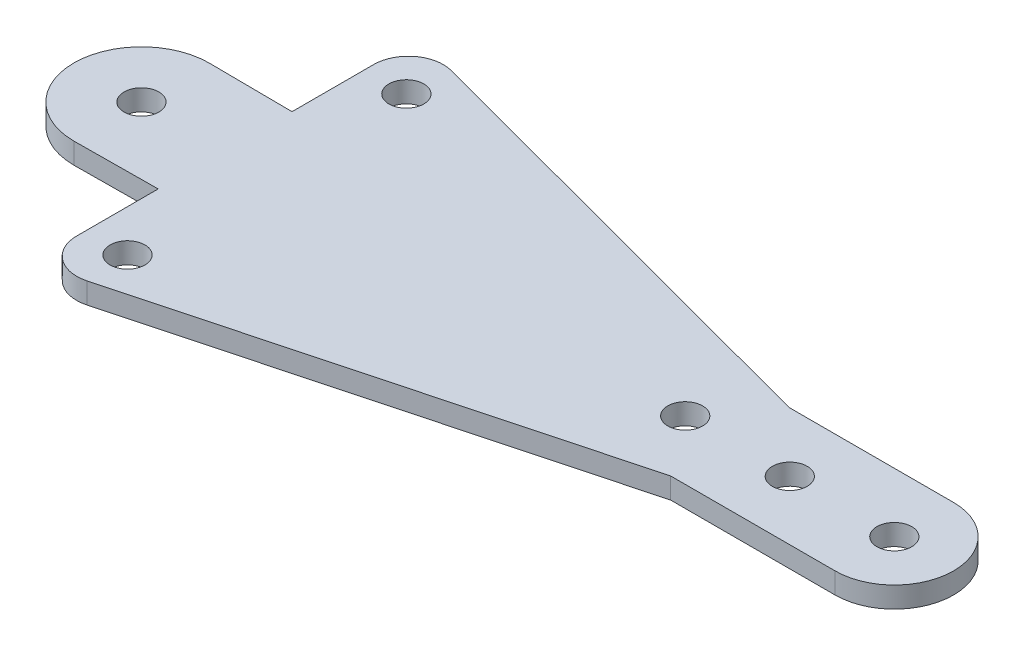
ISO-10303-21;
HEADER;
FILE_DESCRIPTION(('STEP AP214'),'2;1');
FILE_NAME('part.step','',(''),(''),'','','');
FILE_SCHEMA(('AUTOMOTIVE_DESIGN { 1 0 10303 214 1 1 1 1 }'));
ENDSEC;
DATA;
#1=APPLICATION_CONTEXT('core data for automotive mechanical design processes');
#2=APPLICATION_PROTOCOL_DEFINITION('international standard','automotive_design',2000,#1);
#3=PRODUCT_CONTEXT('',#1,'mechanical');
#4=PRODUCT('Part','Part','',(#3));
#5=PRODUCT_RELATED_PRODUCT_CATEGORY('part','',(#4));
#6=PRODUCT_DEFINITION_FORMATION('','',#4);
#7=PRODUCT_DEFINITION_CONTEXT('part definition',#1,'design');
#8=PRODUCT_DEFINITION('design','',#6,#7);
#9=PRODUCT_DEFINITION_SHAPE('','',#8);
#10=(LENGTH_UNIT() NAMED_UNIT(*) SI_UNIT(.MILLI.,.METRE.));
#11=(NAMED_UNIT(*) PLANE_ANGLE_UNIT() SI_UNIT($,.RADIAN.));
#12=(NAMED_UNIT(*) SI_UNIT($,.STERADIAN.) SOLID_ANGLE_UNIT());
#13=UNCERTAINTY_MEASURE_WITH_UNIT(LENGTH_MEASURE(1.E-05),#10,'distance_accuracy_value','');
#14=(GEOMETRIC_REPRESENTATION_CONTEXT(3) GLOBAL_UNCERTAINTY_ASSIGNED_CONTEXT((#13)) GLOBAL_UNIT_ASSIGNED_CONTEXT((#10,
#11,#12)) REPRESENTATION_CONTEXT('',''));
#15=CARTESIAN_POINT('',(0.,0.,0.));
#16=DIRECTION('',(0.,0.,1.));
#17=DIRECTION('',(1.,0.,0.));
#18=AXIS2_PLACEMENT_3D('',#15,#16,#17);
#19=CARTESIAN_POINT('',(-38.5,3.,21.3016116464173));
#20=DIRECTION('',(0.,-1.,0.));
#21=DIRECTION('',(0.,0.,-1.));
#22=AXIS2_PLACEMENT_3D('',#19,#20,#21);
#23=PLANE('',#22);
#24=CARTESIAN_POINT('',(-55.5000000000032,3.,1.02140518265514E-11));
#25=DIRECTION('',(0.,-1.,0.));
#26=DIRECTION('',(0.,0.,-1.));
#27=AXIS2_PLACEMENT_3D('',#24,#25,#26);
#28=CIRCLE('',#27,2.5);
#29=CARTESIAN_POINT('',(-55.5000000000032,3.,-2.49999999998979));
#30=VERTEX_POINT('',#29);
#31=EDGE_CURVE('E215',#30,#30,#28,.T.);
#32=ORIENTED_EDGE('',*,*,#31,.T.);
#33=EDGE_LOOP('',(#32));
#34=FACE_BOUND('',#33,.T.);
#35=CARTESIAN_POINT('',(52.5,3.,0.));
#36=DIRECTION('',(0.,-1.,0.));
#37=DIRECTION('',(0.,0.,-1.));
#38=AXIS2_PLACEMENT_3D('',#35,#36,#37);
#39=CIRCLE('',#38,2.5);
#40=CARTESIAN_POINT('',(52.5,3.,-2.5));
#41=VERTEX_POINT('',#40);
#42=EDGE_CURVE('E218',#41,#41,#39,.T.);
#43=ORIENTED_EDGE('',*,*,#42,.T.);
#44=EDGE_LOOP('',(#43));
#45=FACE_BOUND('',#44,.T.);
#46=CARTESIAN_POINT('',(22.5,3.,0.));
#47=DIRECTION('',(0.,-1.,0.));
#48=DIRECTION('',(0.,0.,-1.));
#49=AXIS2_PLACEMENT_3D('',#46,#47,#48);
#50=CIRCLE('',#49,2.5);
#51=CARTESIAN_POINT('',(22.5,3.,-2.5));
#52=VERTEX_POINT('',#51);
#53=EDGE_CURVE('E230',#52,#52,#50,.T.);
#54=ORIENTED_EDGE('',*,*,#53,.T.);
#55=EDGE_LOOP('',(#54));
#56=FACE_BOUND('',#55,.T.);
#57=CARTESIAN_POINT('',(-37.5,3.,20.));
#58=DIRECTION('',(0.,-1.,0.));
#59=DIRECTION('',(0.,0.,-1.));
#60=AXIS2_PLACEMENT_3D('',#57,#58,#59);
#61=CIRCLE('',#60,2.5);
#62=CARTESIAN_POINT('',(-37.5,3.,17.5));
#63=VERTEX_POINT('',#62);
#64=EDGE_CURVE('E221',#63,#63,#61,.T.);
#65=ORIENTED_EDGE('',*,*,#64,.T.);
#66=EDGE_LOOP('',(#65));
#67=FACE_BOUND('',#66,.T.);
#68=CARTESIAN_POINT('',(37.5,3.,0.));
#69=DIRECTION('',(0.,-1.,0.));
#70=DIRECTION('',(0.,0.,-1.));
#71=AXIS2_PLACEMENT_3D('',#68,#69,#70);
#72=CIRCLE('',#71,2.5);
#73=CARTESIAN_POINT('',(37.5,3.,-2.5));
#74=VERTEX_POINT('',#73);
#75=EDGE_CURVE('E227',#74,#74,#72,.T.);
#76=ORIENTED_EDGE('',*,*,#75,.T.);
#77=EDGE_LOOP('',(#76));
#78=FACE_BOUND('',#77,.T.);
#79=CARTESIAN_POINT('',(-37.5,3.,-20.));
#80=DIRECTION('',(0.,-1.,0.));
#81=DIRECTION('',(0.,0.,-1.));
#82=AXIS2_PLACEMENT_3D('',#79,#80,#81);
#83=CIRCLE('',#82,2.5);
#84=CARTESIAN_POINT('',(-37.5,3.,-22.5));
#85=VERTEX_POINT('',#84);
#86=EDGE_CURVE('E224',#85,#85,#83,.T.);
#87=ORIENTED_EDGE('',*,*,#86,.T.);
#88=EDGE_LOOP('',(#87));
#89=FACE_BOUND('',#88,.T.);
#90=DIRECTION('',(-0.966234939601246,0.,0.257662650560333));
#91=VECTOR('',#90,1.);
#92=CARTESIAN_POINT('',(28.91126204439,3.,8.5));
#93=LINE('',#92,#91);
#94=CARTESIAN_POINT('',(-37.2116867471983,3.,26.1327863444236));
#95=VERTEX_POINT('',#94);
#96=CARTESIAN_POINT('',(28.91126204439,3.,8.5));
#97=VERTEX_POINT('',#96);
#98=EDGE_CURVE('E160',#95,#97,#93,.F.);
#99=ORIENTED_EDGE('',*,*,#98,.T.);
#100=DIRECTION('',(-1.,0.,0.));
#101=VECTOR('',#100,1.);
#102=CARTESIAN_POINT('',(52.5,3.,8.5));
#103=LINE('',#102,#101);
#104=CARTESIAN_POINT('',(52.5,3.,8.5));
#105=VERTEX_POINT('',#104);
#106=EDGE_CURVE('E154',#97,#105,#103,.F.);
#107=ORIENTED_EDGE('',*,*,#106,.T.);
#108=CARTESIAN_POINT('',(52.5,3.,0.));
#109=DIRECTION('',(0.,-1.,0.));
#110=DIRECTION('',(0.,0.,-1.));
#111=AXIS2_PLACEMENT_3D('',#108,#109,#110);
#112=CIRCLE('',#111,8.5);
#113=CARTESIAN_POINT('',(52.5,3.,-8.5));
#114=VERTEX_POINT('',#113);
#115=EDGE_CURVE('E157',#114,#105,#112,.T.);
#116=ORIENTED_EDGE('',*,*,#115,.F.);
#117=DIRECTION('',(1.,0.,0.));
#118=VECTOR('',#117,1.);
#119=CARTESIAN_POINT('',(52.5,3.,-8.5));
#120=LINE('',#119,#118);
#121=CARTESIAN_POINT('',(28.9112620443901,3.,-8.5));
#122=VERTEX_POINT('',#121);
#123=EDGE_CURVE('E119',#114,#122,#120,.F.);
#124=ORIENTED_EDGE('',*,*,#123,.T.);
#125=DIRECTION('',(0.966234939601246,0.,0.257662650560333));
#126=VECTOR('',#125,1.);
#127=CARTESIAN_POINT('',(-37.2116867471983,3.,-26.1327863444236));
#128=LINE('',#127,#126);
#129=CARTESIAN_POINT('',(-37.2116867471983,3.,-26.1327863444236));
#130=VERTEX_POINT('',#129);
#131=EDGE_CURVE('E117',#122,#130,#128,.F.);
#132=ORIENTED_EDGE('',*,*,#131,.T.);
#133=CARTESIAN_POINT('',(-38.5,3.,-21.3016116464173));
#134=DIRECTION('',(0.,-1.,0.));
#135=DIRECTION('',(0.,0.,-1.));
#136=AXIS2_PLACEMENT_3D('',#133,#134,#135);
#137=CIRCLE('',#136,5.);
#138=CARTESIAN_POINT('',(-43.5,3.,-21.3016116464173));
#139=VERTEX_POINT('',#138);
#140=EDGE_CURVE('E104',#139,#130,#137,.T.);
#141=ORIENTED_EDGE('',*,*,#140,.F.);
#142=DIRECTION('',(0.,0.,-1.));
#143=VECTOR('',#142,1.);
#144=CARTESIAN_POINT('',(-43.5,3.,21.3016116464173));
#145=LINE('',#144,#143);
#146=CARTESIAN_POINT('',(-43.5,3.,-9.60011111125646));
#147=VERTEX_POINT('',#146);
#148=EDGE_CURVE('E135',#139,#147,#145,.F.);
#149=ORIENTED_EDGE('',*,*,#148,.T.);
#150=DIRECTION('',(-0.999965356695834,0.,-0.00832378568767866));
#151=VECTOR('',#150,1.);
#152=CARTESIAN_POINT('',(0.0768925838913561,3.,-9.23737383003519));
#153=LINE('',#152,#151);
#154=CARTESIAN_POINT('',(-55.5000000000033,3.,-9.69999999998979));
#155=VERTEX_POINT('',#154);
#156=EDGE_CURVE('E141',#155,#147,#153,.F.);
#157=ORIENTED_EDGE('',*,*,#156,.F.);
#158=CARTESIAN_POINT('',(-55.5000000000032,3.,1.02140518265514E-11));
#159=DIRECTION('',(0.,-1.,0.));
#160=DIRECTION('',(0.,0.,-1.));
#161=AXIS2_PLACEMENT_3D('',#158,#159,#160);
#162=CIRCLE('',#161,9.7);
#163=CARTESIAN_POINT('',(-55.5000000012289,3.,9.70000000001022));
#164=VERTEX_POINT('',#163);
#165=EDGE_CURVE('E142',#164,#155,#162,.T.);
#166=ORIENTED_EDGE('',*,*,#165,.F.);
#167=DIRECTION('',(-0.999965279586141,0.,0.00833304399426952));
#168=VECTOR('',#167,1.);
#169=CARTESIAN_POINT('',(0.076973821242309,3.,9.23685855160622));
#170=LINE('',#169,#168);
#171=CARTESIAN_POINT('',(-43.5,3.,9.60000000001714));
#172=VERTEX_POINT('',#171);
#173=EDGE_CURVE('E148',#164,#172,#170,.F.);
#174=ORIENTED_EDGE('',*,*,#173,.T.);
#175=DIRECTION('',(0.,0.,-1.));
#176=VECTOR('',#175,1.);
#177=CARTESIAN_POINT('',(-43.5,3.,21.3016116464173));
#178=LINE('',#177,#176);
#179=CARTESIAN_POINT('',(-43.5,3.,21.3016116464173));
#180=VERTEX_POINT('',#179);
#181=EDGE_CURVE('E153',#172,#180,#178,.F.);
#182=ORIENTED_EDGE('',*,*,#181,.T.);
#183=CARTESIAN_POINT('',(-38.5,3.,21.3016116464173));
#184=DIRECTION('',(0.,-1.,0.));
#185=DIRECTION('',(0.,0.,-1.));
#186=AXIS2_PLACEMENT_3D('',#183,#184,#185);
#187=CIRCLE('',#186,5.);
#188=EDGE_CURVE('E20',#95,#180,#187,.T.);
#189=ORIENTED_EDGE('',*,*,#188,.F.);
#190=EDGE_LOOP('',(#99,#107,#116,#124,#132,#141,#149,#157,#166,#174,#182,#189));
#191=FACE_BOUND('',#190,.T.);
#192=ADVANCED_FACE('F17',(#34,#45,#56,#67,#78,#89,#191),#23,.F.);
#193=CARTESIAN_POINT('',(-38.5,3.,21.3016116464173));
#194=DIRECTION('',(0.,-1.,0.));
#195=DIRECTION('',(0.,0.,-1.));
#196=AXIS2_PLACEMENT_3D('',#193,#194,#195);
#197=CYLINDRICAL_SURFACE('',#196,5.);
#198=ORIENTED_EDGE('',*,*,#188,.T.);
#199=DIRECTION('',(0.,1.,0.));
#200=VECTOR('',#199,1.);
#201=CARTESIAN_POINT('',(-43.5,3.,21.3016116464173));
#202=LINE('',#201,#200);
#203=CARTESIAN_POINT('',(-43.5,0.,21.3016116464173));
#204=VERTEX_POINT('',#203);
#205=EDGE_CURVE('E151',#180,#204,#202,.F.);
#206=ORIENTED_EDGE('',*,*,#205,.T.);
#207=CARTESIAN_POINT('',(-38.5,0.,21.3016116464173));
#208=DIRECTION('',(0.,-1.,0.));
#209=DIRECTION('',(0.,0.,-1.));
#210=AXIS2_PLACEMENT_3D('',#207,#208,#209);
#211=CIRCLE('',#210,5.);
#212=CARTESIAN_POINT('',(-37.2116867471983,0.,26.1327863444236));
#213=VERTEX_POINT('',#212);
#214=EDGE_CURVE('E211',#213,#204,#211,.T.);
#215=ORIENTED_EDGE('',*,*,#214,.F.);
#216=DIRECTION('',(0.,1.,0.));
#217=VECTOR('',#216,1.);
#218=CARTESIAN_POINT('',(-37.2116867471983,3.,26.1327863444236));
#219=LINE('',#218,#217);
#220=EDGE_CURVE('E162',#213,#95,#219,.T.);
#221=ORIENTED_EDGE('',*,*,#220,.T.);
#222=EDGE_LOOP('',(#198,#206,#215,#221));
#223=FACE_BOUND('',#222,.T.);
#224=ADVANCED_FACE('F457',(#223),#197,.T.);
#225=CARTESIAN_POINT('',(-43.5,3.,21.3016116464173));
#226=DIRECTION('',(1.,0.,0.));
#227=DIRECTION('',(0.,0.,-1.));
#228=AXIS2_PLACEMENT_3D('',#225,#226,#227);
#229=PLANE('',#228);
#230=DIRECTION('',(0.,0.,-1.));
#231=VECTOR('',#230,1.);
#232=CARTESIAN_POINT('',(-43.5,0.,21.3016116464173));
#233=LINE('',#232,#231);
#234=CARTESIAN_POINT('',(-43.5,0.,9.60000000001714));
#235=VERTEX_POINT('',#234);
#236=EDGE_CURVE('E214',#204,#235,#233,.T.);
#237=ORIENTED_EDGE('',*,*,#236,.F.);
#238=ORIENTED_EDGE('',*,*,#205,.F.);
#239=ORIENTED_EDGE('',*,*,#181,.F.);
#240=DIRECTION('',(0.,1.,0.));
#241=VECTOR('',#240,1.);
#242=CARTESIAN_POINT('',(-43.5,3.,9.60000000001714));
#243=LINE('',#242,#241);
#244=EDGE_CURVE('E146',#172,#235,#243,.F.);
#245=ORIENTED_EDGE('',*,*,#244,.T.);
#246=EDGE_LOOP('',(#237,#238,#239,#245));
#247=FACE_BOUND('',#246,.T.);
#248=ADVANCED_FACE('F449',(#247),#229,.F.);
#249=CARTESIAN_POINT('',(0.076973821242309,3.,9.23685855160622));
#250=DIRECTION('',(-0.00833304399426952,0.,-0.999965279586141));
#251=DIRECTION('',(-0.999965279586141,0.,0.00833304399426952));
#252=AXIS2_PLACEMENT_3D('',#249,#250,#251);
#253=PLANE('',#252);
#254=ORIENTED_EDGE('',*,*,#244,.F.);
#255=ORIENTED_EDGE('',*,*,#173,.F.);
#256=DIRECTION('',(0.,-1.,0.));
#257=VECTOR('',#256,1.);
#258=CARTESIAN_POINT('',(-55.5000000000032,3.,9.70000000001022));
#259=LINE('',#258,#257);
#260=CARTESIAN_POINT('',(-55.5000000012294,0.,9.70000000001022));
#261=VERTEX_POINT('',#260);
#262=EDGE_CURVE('E143',#261,#164,#259,.F.);
#263=ORIENTED_EDGE('',*,*,#262,.F.);
#264=DIRECTION('',(-0.999965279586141,0.,0.00833304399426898));
#265=VECTOR('',#264,1.);
#266=CARTESIAN_POINT('',(-43.5,0.,9.60000000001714));
#267=LINE('',#266,#265);
#268=EDGE_CURVE('E210',#235,#261,#267,.T.);
#269=ORIENTED_EDGE('',*,*,#268,.F.);
#270=EDGE_LOOP('',(#254,#255,#263,#269));
#271=FACE_BOUND('',#270,.T.);
#272=ADVANCED_FACE('F441',(#271),#253,.F.);
#273=CARTESIAN_POINT('',(-55.5000000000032,3.,1.02140518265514E-11));
#274=DIRECTION('',(0.,-1.,0.));
#275=DIRECTION('',(0.,0.,-1.));
#276=AXIS2_PLACEMENT_3D('',#273,#274,#275);
#277=CYLINDRICAL_SURFACE('',#276,9.7);
#278=ORIENTED_EDGE('',*,*,#165,.T.);
#279=DIRECTION('',(0.,1.,0.));
#280=VECTOR('',#279,1.);
#281=CARTESIAN_POINT('',(-55.5000000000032,3.,-9.69999999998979));
#282=LINE('',#281,#280);
#283=CARTESIAN_POINT('',(-55.5000000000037,0.,-9.69999999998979));
#284=VERTEX_POINT('',#283);
#285=EDGE_CURVE('E138',#284,#155,#282,.T.);
#286=ORIENTED_EDGE('',*,*,#285,.F.);
#287=CARTESIAN_POINT('',(-55.5000000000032,0.,1.02140518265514E-11));
#288=DIRECTION('',(0.,-1.,0.));
#289=DIRECTION('',(0.,0.,-1.));
#290=AXIS2_PLACEMENT_3D('',#287,#288,#289);
#291=CIRCLE('',#290,9.7);
#292=EDGE_CURVE('E206',#261,#284,#291,.T.);
#293=ORIENTED_EDGE('',*,*,#292,.F.);
#294=ORIENTED_EDGE('',*,*,#262,.T.);
#295=EDGE_LOOP('',(#278,#286,#293,#294));
#296=FACE_BOUND('',#295,.T.);
#297=ADVANCED_FACE('F238',(#296),#277,.T.);
#298=CARTESIAN_POINT('',(0.0768925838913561,3.,-9.23737383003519));
#299=DIRECTION('',(0.00832378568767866,0.,-0.999965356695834));
#300=DIRECTION('',(-0.999965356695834,0.,-0.00832378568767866));
#301=AXIS2_PLACEMENT_3D('',#298,#299,#300);
#302=PLANE('',#301);
#303=ORIENTED_EDGE('',*,*,#156,.T.);
#304=DIRECTION('',(0.,1.,0.));
#305=VECTOR('',#304,1.);
#306=CARTESIAN_POINT('',(-43.5,3.,-9.60011111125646));
#307=LINE('',#306,#305);
#308=CARTESIAN_POINT('',(-43.5,0.,-9.60011111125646));
#309=VERTEX_POINT('',#308);
#310=EDGE_CURVE('E114',#147,#309,#307,.F.);
#311=ORIENTED_EDGE('',*,*,#310,.T.);
#312=DIRECTION('',(0.999965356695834,0.,0.00832378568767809));
#313=VECTOR('',#312,1.);
#314=CARTESIAN_POINT('',(-55.5000000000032,0.,-9.69999999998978));
#315=LINE('',#314,#313);
#316=EDGE_CURVE('E209',#284,#309,#315,.T.);
#317=ORIENTED_EDGE('',*,*,#316,.F.);
#318=ORIENTED_EDGE('',*,*,#285,.T.);
#319=EDGE_LOOP('',(#303,#311,#317,#318));
#320=FACE_BOUND('',#319,.T.);
#321=ADVANCED_FACE('F243',(#320),#302,.T.);
#322=CARTESIAN_POINT('',(-43.5,3.,21.3016116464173));
#323=DIRECTION('',(1.,0.,0.));
#324=DIRECTION('',(0.,0.,-1.));
#325=AXIS2_PLACEMENT_3D('',#322,#323,#324);
#326=PLANE('',#325);
#327=ORIENTED_EDGE('',*,*,#310,.F.);
#328=ORIENTED_EDGE('',*,*,#148,.F.);
#329=DIRECTION('',(0.,-1.,0.));
#330=VECTOR('',#329,1.);
#331=CARTESIAN_POINT('',(-43.5,3.,-21.3016116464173));
#332=LINE('',#331,#330);
#333=CARTESIAN_POINT('',(-43.5,0.,-21.3016116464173));
#334=VERTEX_POINT('',#333);
#335=EDGE_CURVE('E111',#334,#139,#332,.F.);
#336=ORIENTED_EDGE('',*,*,#335,.F.);
#337=DIRECTION('',(0.,0.,-1.));
#338=VECTOR('',#337,1.);
#339=CARTESIAN_POINT('',(-43.5,0.,21.3016116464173));
#340=LINE('',#339,#338);
#341=EDGE_CURVE('E205',#309,#334,#340,.T.);
#342=ORIENTED_EDGE('',*,*,#341,.F.);
#343=EDGE_LOOP('',(#327,#328,#336,#342));
#344=FACE_BOUND('',#343,.T.);
#345=ADVANCED_FACE('F288',(#344),#326,.F.);
#346=CARTESIAN_POINT('',(-38.5,3.,-21.3016116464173));
#347=DIRECTION('',(0.,-1.,0.));
#348=DIRECTION('',(0.,0.,-1.));
#349=AXIS2_PLACEMENT_3D('',#346,#347,#348);
#350=CYLINDRICAL_SURFACE('',#349,5.);
#351=CARTESIAN_POINT('',(-38.5,0.,-21.3016116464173));
#352=DIRECTION('',(0.,-1.,0.));
#353=DIRECTION('',(0.,0.,-1.));
#354=AXIS2_PLACEMENT_3D('',#351,#352,#353);
#355=CIRCLE('',#354,5.);
#356=CARTESIAN_POINT('',(-37.2116867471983,0.,-26.1327863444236));
#357=VERTEX_POINT('',#356);
#358=EDGE_CURVE('E202',#334,#357,#355,.T.);
#359=ORIENTED_EDGE('',*,*,#358,.F.);
#360=ORIENTED_EDGE('',*,*,#335,.T.);
#361=ORIENTED_EDGE('',*,*,#140,.T.);
#362=DIRECTION('',(0.,1.,0.));
#363=VECTOR('',#362,1.);
#364=CARTESIAN_POINT('',(-37.2116867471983,3.,-26.1327863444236));
#365=LINE('',#364,#363);
#366=EDGE_CURVE('E109',#130,#357,#365,.F.);
#367=ORIENTED_EDGE('',*,*,#366,.T.);
#368=EDGE_LOOP('',(#359,#360,#361,#367));
#369=FACE_BOUND('',#368,.T.);
#370=ADVANCED_FACE('F107',(#369),#350,.T.);
#371=CARTESIAN_POINT('',(-37.2116867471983,3.,-26.1327863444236));
#372=DIRECTION('',(-0.257662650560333,0.,0.966234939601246));
#373=DIRECTION('',(0.966234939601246,0.,0.257662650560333));
#374=AXIS2_PLACEMENT_3D('',#371,#372,#373);
#375=PLANE('',#374);
#376=ORIENTED_EDGE('',*,*,#366,.F.);
#377=ORIENTED_EDGE('',*,*,#131,.F.);
#378=DIRECTION('',(0.,-1.,0.));
#379=VECTOR('',#378,1.);
#380=CARTESIAN_POINT('',(28.91126204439,3.,-8.5));
#381=LINE('',#380,#379);
#382=CARTESIAN_POINT('',(28.91126204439,0.,-8.5));
#383=VERTEX_POINT('',#382);
#384=EDGE_CURVE('E127',#122,#383,#381,.T.);
#385=ORIENTED_EDGE('',*,*,#384,.T.);
#386=DIRECTION('',(0.966234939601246,0.,0.257662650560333));
#387=VECTOR('',#386,1.);
#388=CARTESIAN_POINT('',(-37.2116867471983,0.,-26.1327863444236));
#389=LINE('',#388,#387);
#390=EDGE_CURVE('E125',#357,#383,#389,.T.);
#391=ORIENTED_EDGE('',*,*,#390,.F.);
#392=EDGE_LOOP('',(#376,#377,#385,#391));
#393=FACE_BOUND('',#392,.T.);
#394=ADVANCED_FACE('F123',(#393),#375,.F.);
#395=CARTESIAN_POINT('',(52.5,3.,-8.5));
#396=DIRECTION('',(0.,0.,1.));
#397=DIRECTION('',(0.,-1.,0.));
#398=AXIS2_PLACEMENT_3D('',#395,#396,#397);
#399=PLANE('',#398);
#400=ORIENTED_EDGE('',*,*,#384,.F.);
#401=ORIENTED_EDGE('',*,*,#123,.F.);
#402=DIRECTION('',(0.,-1.,0.));
#403=VECTOR('',#402,1.);
#404=CARTESIAN_POINT('',(52.5,3.,-8.5));
#405=LINE('',#404,#403);
#406=CARTESIAN_POINT('',(52.5,0.,-8.5));
#407=VERTEX_POINT('',#406);
#408=EDGE_CURVE('E234',#407,#114,#405,.F.);
#409=ORIENTED_EDGE('',*,*,#408,.F.);
#410=DIRECTION('',(1.,0.,0.));
#411=VECTOR('',#410,1.);
#412=CARTESIAN_POINT('',(-38.5,0.,-8.5));
#413=LINE('',#412,#411);
#414=EDGE_CURVE('E201',#383,#407,#413,.T.);
#415=ORIENTED_EDGE('',*,*,#414,.F.);
#416=EDGE_LOOP('',(#400,#401,#409,#415));
#417=FACE_BOUND('',#416,.T.);
#418=ADVANCED_FACE('F276',(#417),#399,.F.);
#419=CARTESIAN_POINT('',(52.5,3.,0.));
#420=DIRECTION('',(0.,-1.,0.));
#421=DIRECTION('',(0.,0.,-1.));
#422=AXIS2_PLACEMENT_3D('',#419,#420,#421);
#423=CYLINDRICAL_SURFACE('',#422,8.5);
#424=ORIENTED_EDGE('',*,*,#115,.T.);
#425=DIRECTION('',(0.,1.,0.));
#426=VECTOR('',#425,1.);
#427=CARTESIAN_POINT('',(52.5,3.,8.5));
#428=LINE('',#427,#426);
#429=CARTESIAN_POINT('',(52.5,0.,8.5));
#430=VERTEX_POINT('',#429);
#431=EDGE_CURVE('E156',#105,#430,#428,.F.);
#432=ORIENTED_EDGE('',*,*,#431,.T.);
#433=CARTESIAN_POINT('',(52.5,0.,0.));
#434=DIRECTION('',(0.,-1.,0.));
#435=DIRECTION('',(0.,0.,-1.));
#436=AXIS2_PLACEMENT_3D('',#433,#434,#435);
#437=CIRCLE('',#436,8.5);
#438=EDGE_CURVE('E197',#407,#430,#437,.T.);
#439=ORIENTED_EDGE('',*,*,#438,.F.);
#440=ORIENTED_EDGE('',*,*,#408,.T.);
#441=EDGE_LOOP('',(#424,#432,#439,#440));
#442=FACE_BOUND('',#441,.T.);
#443=ADVANCED_FACE('F336',(#442),#423,.T.);
#444=CARTESIAN_POINT('',(52.5,3.,8.5));
#445=DIRECTION('',(0.,0.,-1.));
#446=DIRECTION('',(-1.,0.,0.));
#447=AXIS2_PLACEMENT_3D('',#444,#445,#446);
#448=PLANE('',#447);
#449=ORIENTED_EDGE('',*,*,#431,.F.);
#450=ORIENTED_EDGE('',*,*,#106,.F.);
#451=DIRECTION('',(0.,1.,0.));
#452=VECTOR('',#451,1.);
#453=CARTESIAN_POINT('',(28.91126204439,3.,8.5));
#454=LINE('',#453,#452);
#455=CARTESIAN_POINT('',(28.9112620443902,0.,8.49999999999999));
#456=VERTEX_POINT('',#455);
#457=EDGE_CURVE('E35',#97,#456,#454,.F.);
#458=ORIENTED_EDGE('',*,*,#457,.T.);
#459=DIRECTION('',(1.,0.,0.));
#460=VECTOR('',#459,1.);
#461=CARTESIAN_POINT('',(-38.5,0.,8.5));
#462=LINE('',#461,#460);
#463=EDGE_CURVE('E200',#430,#456,#462,.F.);
#464=ORIENTED_EDGE('',*,*,#463,.F.);
#465=EDGE_LOOP('',(#449,#450,#458,#464));
#466=FACE_BOUND('',#465,.T.);
#467=ADVANCED_FACE('F332',(#466),#448,.F.);
#468=CARTESIAN_POINT('',(28.91126204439,3.,8.5));
#469=DIRECTION('',(-0.257662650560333,0.,-0.966234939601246));
#470=DIRECTION('',(-0.966234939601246,0.,0.257662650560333));
#471=AXIS2_PLACEMENT_3D('',#468,#469,#470);
#472=PLANE('',#471);
#473=ORIENTED_EDGE('',*,*,#457,.F.);
#474=ORIENTED_EDGE('',*,*,#98,.F.);
#475=ORIENTED_EDGE('',*,*,#220,.F.);
#476=DIRECTION('',(-0.966234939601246,0.,0.257662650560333));
#477=VECTOR('',#476,1.);
#478=CARTESIAN_POINT('',(28.91126204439,0.,8.5));
#479=LINE('',#478,#477);
#480=EDGE_CURVE('E196',#456,#213,#479,.T.);
#481=ORIENTED_EDGE('',*,*,#480,.F.);
#482=EDGE_LOOP('',(#473,#474,#475,#481));
#483=FACE_BOUND('',#482,.T.);
#484=ADVANCED_FACE('F328',(#483),#472,.F.);
#485=CARTESIAN_POINT('',(22.5,3.,0.));
#486=DIRECTION('',(0.,-1.,0.));
#487=DIRECTION('',(0.,0.,-1.));
#488=AXIS2_PLACEMENT_3D('',#485,#486,#487);
#489=CYLINDRICAL_SURFACE('',#488,2.5);
#490=ORIENTED_EDGE('',*,*,#53,.F.);
#491=EDGE_LOOP('',(#490));
#492=FACE_BOUND('',#491,.T.);
#493=CARTESIAN_POINT('',(22.5,0.,0.));
#494=DIRECTION('',(0.,-1.,0.));
#495=DIRECTION('',(0.,0.,-1.));
#496=AXIS2_PLACEMENT_3D('',#493,#494,#495);
#497=CIRCLE('',#496,2.5);
#498=CARTESIAN_POINT('',(22.5,0.,-2.5));
#499=VERTEX_POINT('',#498);
#500=EDGE_CURVE('E193',#499,#499,#497,.F.);
#501=ORIENTED_EDGE('',*,*,#500,.F.);
#502=EDGE_LOOP('',(#501));
#503=FACE_BOUND('',#502,.T.);
#504=ADVANCED_FACE('F324',(#492,#503),#489,.F.);
#505=CARTESIAN_POINT('',(37.5,3.,0.));
#506=DIRECTION('',(0.,-1.,0.));
#507=DIRECTION('',(0.,0.,-1.));
#508=AXIS2_PLACEMENT_3D('',#505,#506,#507);
#509=CYLINDRICAL_SURFACE('',#508,2.5);
#510=ORIENTED_EDGE('',*,*,#75,.F.);
#511=EDGE_LOOP('',(#510));
#512=FACE_BOUND('',#511,.T.);
#513=CARTESIAN_POINT('',(37.5,0.,0.));
#514=DIRECTION('',(0.,-1.,0.));
#515=DIRECTION('',(0.,0.,-1.));
#516=AXIS2_PLACEMENT_3D('',#513,#514,#515);
#517=CIRCLE('',#516,2.5);
#518=CARTESIAN_POINT('',(37.5,0.,-2.5));
#519=VERTEX_POINT('',#518);
#520=EDGE_CURVE('E190',#519,#519,#517,.F.);
#521=ORIENTED_EDGE('',*,*,#520,.F.);
#522=EDGE_LOOP('',(#521));
#523=FACE_BOUND('',#522,.T.);
#524=ADVANCED_FACE('F320',(#512,#523),#509,.F.);
#525=CARTESIAN_POINT('',(-37.5,3.,-20.));
#526=DIRECTION('',(0.,-1.,0.));
#527=DIRECTION('',(0.,0.,-1.));
#528=AXIS2_PLACEMENT_3D('',#525,#526,#527);
#529=CYLINDRICAL_SURFACE('',#528,2.5);
#530=ORIENTED_EDGE('',*,*,#86,.F.);
#531=EDGE_LOOP('',(#530));
#532=FACE_BOUND('',#531,.T.);
#533=CARTESIAN_POINT('',(-37.5,0.,-20.));
#534=DIRECTION('',(0.,-1.,0.));
#535=DIRECTION('',(0.,0.,-1.));
#536=AXIS2_PLACEMENT_3D('',#533,#534,#535);
#537=CIRCLE('',#536,2.5);
#538=CARTESIAN_POINT('',(-37.5,0.,-22.5));
#539=VERTEX_POINT('',#538);
#540=EDGE_CURVE('E187',#539,#539,#537,.F.);
#541=ORIENTED_EDGE('',*,*,#540,.F.);
#542=EDGE_LOOP('',(#541));
#543=FACE_BOUND('',#542,.T.);
#544=ADVANCED_FACE('F316',(#532,#543),#529,.F.);
#545=CARTESIAN_POINT('',(-37.5,3.,20.));
#546=DIRECTION('',(0.,-1.,0.));
#547=DIRECTION('',(0.,0.,-1.));
#548=AXIS2_PLACEMENT_3D('',#545,#546,#547);
#549=CYLINDRICAL_SURFACE('',#548,2.5);
#550=ORIENTED_EDGE('',*,*,#64,.F.);
#551=EDGE_LOOP('',(#550));
#552=FACE_BOUND('',#551,.T.);
#553=CARTESIAN_POINT('',(-37.5,0.,20.));
#554=DIRECTION('',(0.,-1.,0.));
#555=DIRECTION('',(0.,0.,-1.));
#556=AXIS2_PLACEMENT_3D('',#553,#554,#555);
#557=CIRCLE('',#556,2.5);
#558=CARTESIAN_POINT('',(-37.5,0.,17.5));
#559=VERTEX_POINT('',#558);
#560=EDGE_CURVE('E184',#559,#559,#557,.F.);
#561=ORIENTED_EDGE('',*,*,#560,.F.);
#562=EDGE_LOOP('',(#561));
#563=FACE_BOUND('',#562,.T.);
#564=ADVANCED_FACE('F312',(#552,#563),#549,.F.);
#565=CARTESIAN_POINT('',(52.5,3.,0.));
#566=DIRECTION('',(0.,-1.,0.));
#567=DIRECTION('',(0.,0.,-1.));
#568=AXIS2_PLACEMENT_3D('',#565,#566,#567);
#569=CYLINDRICAL_SURFACE('',#568,2.5);
#570=ORIENTED_EDGE('',*,*,#42,.F.);
#571=EDGE_LOOP('',(#570));
#572=FACE_BOUND('',#571,.T.);
#573=CARTESIAN_POINT('',(52.5,0.,0.));
#574=DIRECTION('',(0.,-1.,0.));
#575=DIRECTION('',(0.,0.,-1.));
#576=AXIS2_PLACEMENT_3D('',#573,#574,#575);
#577=CIRCLE('',#576,2.5);
#578=CARTESIAN_POINT('',(52.5,0.,-2.5));
#579=VERTEX_POINT('',#578);
#580=EDGE_CURVE('E26',#579,#579,#577,.F.);
#581=ORIENTED_EDGE('',*,*,#580,.F.);
#582=EDGE_LOOP('',(#581));
#583=FACE_BOUND('',#582,.T.);
#584=ADVANCED_FACE('F305',(#572,#583),#569,.F.);
#585=CARTESIAN_POINT('',(-55.5000000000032,3.,1.02140518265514E-11));
#586=DIRECTION('',(0.,-1.,0.));
#587=DIRECTION('',(0.,0.,-1.));
#588=AXIS2_PLACEMENT_3D('',#585,#586,#587);
#589=CYLINDRICAL_SURFACE('',#588,2.5);
#590=CARTESIAN_POINT('',(-55.5000000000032,0.,1.02140518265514E-11));
#591=DIRECTION('',(0.,-1.,0.));
#592=DIRECTION('',(0.,0.,-1.));
#593=AXIS2_PLACEMENT_3D('',#590,#591,#592);
#594=CIRCLE('',#593,2.5);
#595=CARTESIAN_POINT('',(-55.5000000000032,0.,-2.49999999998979));
#596=VERTEX_POINT('',#595);
#597=EDGE_CURVE('E11',#596,#596,#594,.F.);
#598=ORIENTED_EDGE('',*,*,#597,.F.);
#599=EDGE_LOOP('',(#598));
#600=FACE_BOUND('',#599,.T.);
#601=ORIENTED_EDGE('',*,*,#31,.F.);
#602=EDGE_LOOP('',(#601));
#603=FACE_BOUND('',#602,.T.);
#604=ADVANCED_FACE('F299',(#600,#603),#589,.F.);
#605=CARTESIAN_POINT('',(-38.5,0.,21.3016116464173));
#606=DIRECTION('',(0.,-1.,0.));
#607=DIRECTION('',(0.,0.,-1.));
#608=AXIS2_PLACEMENT_3D('',#605,#606,#607);
#609=PLANE('',#608);
#610=ORIENTED_EDGE('',*,*,#597,.T.);
#611=EDGE_LOOP('',(#610));
#612=FACE_BOUND('',#611,.T.);
#613=ORIENTED_EDGE('',*,*,#580,.T.);
#614=EDGE_LOOP('',(#613));
#615=FACE_BOUND('',#614,.T.);
#616=ORIENTED_EDGE('',*,*,#560,.T.);
#617=EDGE_LOOP('',(#616));
#618=FACE_BOUND('',#617,.T.);
#619=ORIENTED_EDGE('',*,*,#540,.T.);
#620=EDGE_LOOP('',(#619));
#621=FACE_BOUND('',#620,.T.);
#622=ORIENTED_EDGE('',*,*,#520,.T.);
#623=EDGE_LOOP('',(#622));
#624=FACE_BOUND('',#623,.T.);
#625=ORIENTED_EDGE('',*,*,#500,.T.);
#626=EDGE_LOOP('',(#625));
#627=FACE_BOUND('',#626,.T.);
#628=ORIENTED_EDGE('',*,*,#463,.T.);
#629=ORIENTED_EDGE('',*,*,#480,.T.);
#630=ORIENTED_EDGE('',*,*,#214,.T.);
#631=ORIENTED_EDGE('',*,*,#236,.T.);
#632=ORIENTED_EDGE('',*,*,#268,.T.);
#633=ORIENTED_EDGE('',*,*,#292,.T.);
#634=ORIENTED_EDGE('',*,*,#316,.T.);
#635=ORIENTED_EDGE('',*,*,#341,.T.);
#636=ORIENTED_EDGE('',*,*,#358,.T.);
#637=ORIENTED_EDGE('',*,*,#390,.T.);
#638=ORIENTED_EDGE('',*,*,#414,.T.);
#639=ORIENTED_EDGE('',*,*,#438,.T.);
#640=EDGE_LOOP('',(#628,#629,#630,#631,#632,#633,#634,#635,#636,#637,#638,#639));
#641=FACE_BOUND('',#640,.T.);
#642=ADVANCED_FACE('F251',(#612,#615,#618,#621,#624,#627,#641),#609,.T.);
#643=CLOSED_SHELL('',(#192,#224,#248,#272,#297,#321,#345,#370,#394,#418,#443,#467,#484,#504,
#524,#544,#564,#584,#604,#642));
#644=MANIFOLD_SOLID_BREP('B1',#643);
#645=ADVANCED_BREP_SHAPE_REPRESENTATION('',(#18,#644),#14);
#646=SHAPE_DEFINITION_REPRESENTATION(#9,#645);
ENDSEC;
END-ISO-10303-21;
